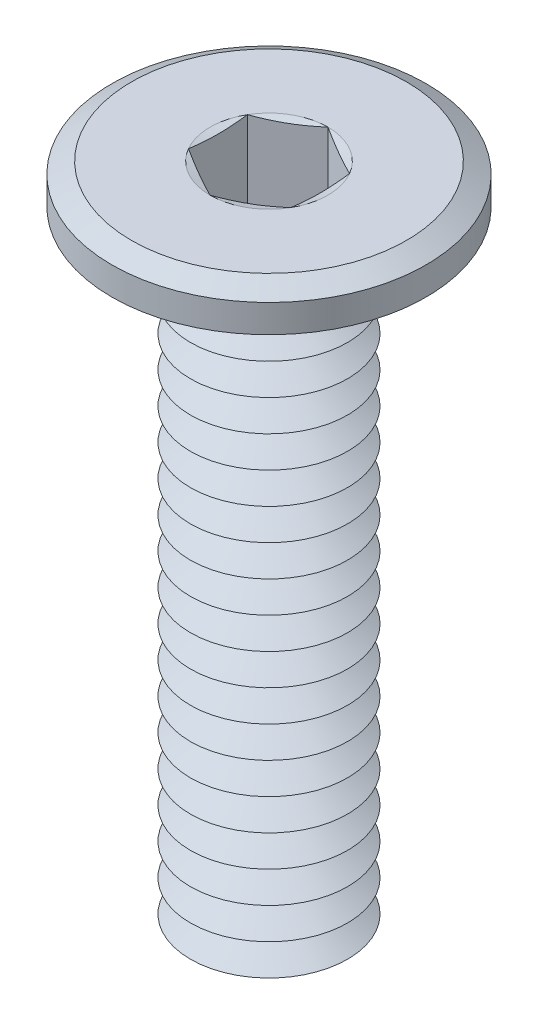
ISO-10303-21;
HEADER;
FILE_DESCRIPTION(('STEP AP214'),'2;1');
FILE_NAME('part.step','',(''),(''),'','','');
FILE_SCHEMA(('AUTOMOTIVE_DESIGN { 1 0 10303 214 1 1 1 1 }'));
ENDSEC;
DATA;
#1=APPLICATION_CONTEXT('core data for automotive mechanical design processes');
#2=APPLICATION_PROTOCOL_DEFINITION('international standard','automotive_design',2000,#1);
#3=PRODUCT_CONTEXT('',#1,'mechanical');
#4=PRODUCT('Part','Part','',(#3));
#5=PRODUCT_RELATED_PRODUCT_CATEGORY('part','',(#4));
#6=PRODUCT_DEFINITION_FORMATION('','',#4);
#7=PRODUCT_DEFINITION_CONTEXT('part definition',#1,'design');
#8=PRODUCT_DEFINITION('design','',#6,#7);
#9=PRODUCT_DEFINITION_SHAPE('','',#8);
#10=(LENGTH_UNIT() NAMED_UNIT(*) SI_UNIT(.MILLI.,.METRE.));
#11=(NAMED_UNIT(*) PLANE_ANGLE_UNIT() SI_UNIT($,.RADIAN.));
#12=(NAMED_UNIT(*) SI_UNIT($,.STERADIAN.) SOLID_ANGLE_UNIT());
#13=UNCERTAINTY_MEASURE_WITH_UNIT(LENGTH_MEASURE(1.E-05),#10,'distance_accuracy_value','');
#14=(GEOMETRIC_REPRESENTATION_CONTEXT(3) GLOBAL_UNCERTAINTY_ASSIGNED_CONTEXT((#13)) GLOBAL_UNIT_ASSIGNED_CONTEXT((#10,
#11,#12)) REPRESENTATION_CONTEXT('',''));
#15=CARTESIAN_POINT('',(0.,0.,0.));
#16=DIRECTION('',(0.,0.,1.));
#17=DIRECTION('',(1.,0.,0.));
#18=AXIS2_PLACEMENT_3D('',#15,#16,#17);
#19=CARTESIAN_POINT('',(0.,-7.9,0.));
#20=DIRECTION('',(0.,-1.,0.));
#21=DIRECTION('',(0.,0.,-1.));
#22=AXIS2_PLACEMENT_3D('',#19,#20,#21);
#23=CONICAL_SURFACE('',#22,1.,1.0471975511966);
#24=CARTESIAN_POINT('',(0.,-7.7,0.));
#25=DIRECTION('',(0.,1.,0.));
#26=DIRECTION('',(0.,0.,1.));
#27=AXIS2_PLACEMENT_3D('',#24,#25,#26);
#28=CIRCLE('',#27,0.653589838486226);
#29=CARTESIAN_POINT('',(0.,-7.7,0.653589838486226));
#30=VERTEX_POINT('',#29);
#31=EDGE_CURVE('E506',#30,#30,#28,.T.);
#32=ORIENTED_EDGE('',*,*,#31,.F.);
#33=EDGE_LOOP('',(#32));
#34=FACE_BOUND('',#33,.T.);
#35=CARTESIAN_POINT('',(0.,-7.9,0.));
#36=DIRECTION('',(0.,1.,0.));
#37=DIRECTION('',(0.,0.,1.));
#38=AXIS2_PLACEMENT_3D('',#35,#36,#37);
#39=CIRCLE('',#38,1.);
#40=CARTESIAN_POINT('',(0.,-7.9,1.));
#41=VERTEX_POINT('',#40);
#42=EDGE_CURVE('E510',#41,#41,#39,.T.);
#43=ORIENTED_EDGE('',*,*,#42,.T.);
#44=EDGE_LOOP('',(#43));
#45=FACE_BOUND('',#44,.T.);
#46=ADVANCED_FACE('F39',(#34,#45),#23,.T.);
#47=CARTESIAN_POINT('',(0.,-7.7,0.));
#48=DIRECTION('',(0.,1.,0.));
#49=DIRECTION('',(0.,0.,1.));
#50=AXIS2_PLACEMENT_3D('',#47,#48,#49);
#51=CONICAL_SURFACE('',#50,0.653589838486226,1.0471975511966);
#52=CARTESIAN_POINT('',(0.,-7.5,0.));
#53=DIRECTION('',(0.,1.,0.));
#54=DIRECTION('',(0.,0.,1.));
#55=AXIS2_PLACEMENT_3D('',#52,#53,#54);
#56=CIRCLE('',#55,1.);
#57=CARTESIAN_POINT('',(0.,-7.5,1.));
#58=VERTEX_POINT('',#57);
#59=EDGE_CURVE('E502',#58,#58,#56,.T.);
#60=ORIENTED_EDGE('',*,*,#59,.F.);
#61=EDGE_LOOP('',(#60));
#62=FACE_BOUND('',#61,.T.);
#63=ORIENTED_EDGE('',*,*,#31,.T.);
#64=EDGE_LOOP('',(#63));
#65=FACE_BOUND('',#64,.T.);
#66=ADVANCED_FACE('F233',(#62,#65),#51,.T.);
#67=CARTESIAN_POINT('',(0.,-8.5,0.));
#68=DIRECTION('',(0.,-1.,0.));
#69=DIRECTION('',(0.,0.,-1.));
#70=AXIS2_PLACEMENT_3D('',#67,#68,#69);
#71=PLANE('',#70);
#72=CARTESIAN_POINT('',(0.,-8.5,0.));
#73=DIRECTION('',(0.,1.,0.));
#74=DIRECTION('',(0.,0.,1.));
#75=AXIS2_PLACEMENT_3D('',#72,#73,#74);
#76=CIRCLE('',#75,0.653589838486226);
#77=CARTESIAN_POINT('',(0.,-8.5,0.653589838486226));
#78=VERTEX_POINT('',#77);
#79=EDGE_CURVE('E300',#78,#78,#76,.T.);
#80=ORIENTED_EDGE('',*,*,#79,.F.);
#81=EDGE_LOOP('',(#80));
#82=FACE_BOUND('',#81,.T.);
#83=ADVANCED_FACE('F239',(#82),#71,.T.);
#84=CARTESIAN_POINT('',(0.,-8.5,0.));
#85=DIRECTION('',(0.,1.,0.));
#86=DIRECTION('',(0.,0.,1.));
#87=AXIS2_PLACEMENT_3D('',#84,#85,#86);
#88=CONICAL_SURFACE('',#87,0.653589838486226,1.0471975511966);
#89=CARTESIAN_POINT('',(0.,-8.3,0.));
#90=DIRECTION('',(0.,1.,0.));
#91=DIRECTION('',(0.,0.,1.));
#92=AXIS2_PLACEMENT_3D('',#89,#90,#91);
#93=CIRCLE('',#92,1.);
#94=CARTESIAN_POINT('',(0.,-8.3,1.));
#95=VERTEX_POINT('',#94);
#96=EDGE_CURVE('E517',#95,#95,#93,.T.);
#97=ORIENTED_EDGE('',*,*,#96,.F.);
#98=EDGE_LOOP('',(#97));
#99=FACE_BOUND('',#98,.T.);
#100=ORIENTED_EDGE('',*,*,#79,.T.);
#101=EDGE_LOOP('',(#100));
#102=FACE_BOUND('',#101,.T.);
#103=ADVANCED_FACE('F254',(#99,#102),#88,.T.);
#104=CARTESIAN_POINT('',(0.,-8.3,0.));
#105=DIRECTION('',(0.,-1.,0.));
#106=DIRECTION('',(0.,0.,-1.));
#107=AXIS2_PLACEMENT_3D('',#104,#105,#106);
#108=CONICAL_SURFACE('',#107,1.,1.0471975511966);
#109=CARTESIAN_POINT('',(0.,-8.1,0.));
#110=DIRECTION('',(0.,1.,0.));
#111=DIRECTION('',(0.,0.,1.));
#112=AXIS2_PLACEMENT_3D('',#109,#110,#111);
#113=CIRCLE('',#112,0.653589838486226);
#114=CARTESIAN_POINT('',(0.,-8.1,0.653589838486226));
#115=VERTEX_POINT('',#114);
#116=EDGE_CURVE('E513',#115,#115,#113,.T.);
#117=ORIENTED_EDGE('',*,*,#116,.F.);
#118=EDGE_LOOP('',(#117));
#119=FACE_BOUND('',#118,.T.);
#120=ORIENTED_EDGE('',*,*,#96,.T.);
#121=EDGE_LOOP('',(#120));
#122=FACE_BOUND('',#121,.T.);
#123=ADVANCED_FACE('F250',(#119,#122),#108,.T.);
#124=CARTESIAN_POINT('',(0.,-8.1,0.));
#125=DIRECTION('',(0.,1.,0.));
#126=DIRECTION('',(0.,0.,1.));
#127=AXIS2_PLACEMENT_3D('',#124,#125,#126);
#128=CONICAL_SURFACE('',#127,0.653589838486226,1.0471975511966);
#129=ORIENTED_EDGE('',*,*,#42,.F.);
#130=EDGE_LOOP('',(#129));
#131=FACE_BOUND('',#130,.T.);
#132=ORIENTED_EDGE('',*,*,#116,.T.);
#133=EDGE_LOOP('',(#132));
#134=FACE_BOUND('',#133,.T.);
#135=ADVANCED_FACE('F246',(#131,#134),#128,.T.);
#136=CARTESIAN_POINT('',(0.,-7.5,0.));
#137=DIRECTION('',(0.,-1.,0.));
#138=DIRECTION('',(0.,0.,-1.));
#139=AXIS2_PLACEMENT_3D('',#136,#137,#138);
#140=CONICAL_SURFACE('',#139,1.,1.0471975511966);
#141=CARTESIAN_POINT('',(0.,-7.3,0.));
#142=DIRECTION('',(0.,1.,0.));
#143=DIRECTION('',(0.,0.,1.));
#144=AXIS2_PLACEMENT_3D('',#141,#142,#143);
#145=CIRCLE('',#144,0.653589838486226);
#146=CARTESIAN_POINT('',(0.,-7.3,0.653589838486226));
#147=VERTEX_POINT('',#146);
#148=EDGE_CURVE('E498',#147,#147,#145,.T.);
#149=ORIENTED_EDGE('',*,*,#148,.F.);
#150=EDGE_LOOP('',(#149));
#151=FACE_BOUND('',#150,.T.);
#152=ORIENTED_EDGE('',*,*,#59,.T.);
#153=EDGE_LOOP('',(#152));
#154=FACE_BOUND('',#153,.T.);
#155=ADVANCED_FACE('F249',(#151,#154),#140,.T.);
#156=CARTESIAN_POINT('',(0.,-7.3,0.));
#157=DIRECTION('',(0.,1.,0.));
#158=DIRECTION('',(0.,0.,1.));
#159=AXIS2_PLACEMENT_3D('',#156,#157,#158);
#160=CONICAL_SURFACE('',#159,0.653589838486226,1.0471975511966);
#161=CARTESIAN_POINT('',(0.,-7.1,0.));
#162=DIRECTION('',(0.,1.,0.));
#163=DIRECTION('',(0.,0.,1.));
#164=AXIS2_PLACEMENT_3D('',#161,#162,#163);
#165=CIRCLE('',#164,1.);
#166=CARTESIAN_POINT('',(0.,-7.1,1.));
#167=VERTEX_POINT('',#166);
#168=EDGE_CURVE('E494',#167,#167,#165,.T.);
#169=ORIENTED_EDGE('',*,*,#168,.F.);
#170=EDGE_LOOP('',(#169));
#171=FACE_BOUND('',#170,.T.);
#172=ORIENTED_EDGE('',*,*,#148,.T.);
#173=EDGE_LOOP('',(#172));
#174=FACE_BOUND('',#173,.T.);
#175=ADVANCED_FACE('F890',(#171,#174),#160,.T.);
#176=CARTESIAN_POINT('',(0.,-7.1,0.));
#177=DIRECTION('',(0.,-1.,0.));
#178=DIRECTION('',(0.,0.,-1.));
#179=AXIS2_PLACEMENT_3D('',#176,#177,#178);
#180=CONICAL_SURFACE('',#179,1.,1.0471975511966);
#181=CARTESIAN_POINT('',(0.,-6.9,0.));
#182=DIRECTION('',(0.,1.,0.));
#183=DIRECTION('',(0.,0.,1.));
#184=AXIS2_PLACEMENT_3D('',#181,#182,#183);
#185=CIRCLE('',#184,0.653589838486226);
#186=CARTESIAN_POINT('',(0.,-6.9,0.653589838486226));
#187=VERTEX_POINT('',#186);
#188=EDGE_CURVE('E490',#187,#187,#185,.T.);
#189=ORIENTED_EDGE('',*,*,#188,.F.);
#190=EDGE_LOOP('',(#189));
#191=FACE_BOUND('',#190,.T.);
#192=ORIENTED_EDGE('',*,*,#168,.T.);
#193=EDGE_LOOP('',(#192));
#194=FACE_BOUND('',#193,.T.);
#195=ADVANCED_FACE('F881',(#191,#194),#180,.T.);
#196=CARTESIAN_POINT('',(0.,-6.9,0.));
#197=DIRECTION('',(0.,1.,0.));
#198=DIRECTION('',(0.,0.,1.));
#199=AXIS2_PLACEMENT_3D('',#196,#197,#198);
#200=CONICAL_SURFACE('',#199,0.653589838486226,1.0471975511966);
#201=CARTESIAN_POINT('',(0.,-6.7,0.));
#202=DIRECTION('',(0.,1.,0.));
#203=DIRECTION('',(0.,0.,1.));
#204=AXIS2_PLACEMENT_3D('',#201,#202,#203);
#205=CIRCLE('',#204,1.);
#206=CARTESIAN_POINT('',(0.,-6.7,1.));
#207=VERTEX_POINT('',#206);
#208=EDGE_CURVE('E486',#207,#207,#205,.T.);
#209=ORIENTED_EDGE('',*,*,#208,.F.);
#210=EDGE_LOOP('',(#209));
#211=FACE_BOUND('',#210,.T.);
#212=ORIENTED_EDGE('',*,*,#188,.T.);
#213=EDGE_LOOP('',(#212));
#214=FACE_BOUND('',#213,.T.);
#215=ADVANCED_FACE('F872',(#211,#214),#200,.T.);
#216=CARTESIAN_POINT('',(0.,-6.7,0.));
#217=DIRECTION('',(0.,-1.,0.));
#218=DIRECTION('',(0.,0.,-1.));
#219=AXIS2_PLACEMENT_3D('',#216,#217,#218);
#220=CONICAL_SURFACE('',#219,1.,1.0471975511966);
#221=CARTESIAN_POINT('',(0.,-6.5,0.));
#222=DIRECTION('',(0.,1.,0.));
#223=DIRECTION('',(0.,0.,1.));
#224=AXIS2_PLACEMENT_3D('',#221,#222,#223);
#225=CIRCLE('',#224,0.653589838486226);
#226=CARTESIAN_POINT('',(0.,-6.5,0.653589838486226));
#227=VERTEX_POINT('',#226);
#228=EDGE_CURVE('E482',#227,#227,#225,.T.);
#229=ORIENTED_EDGE('',*,*,#228,.F.);
#230=EDGE_LOOP('',(#229));
#231=FACE_BOUND('',#230,.T.);
#232=ORIENTED_EDGE('',*,*,#208,.T.);
#233=EDGE_LOOP('',(#232));
#234=FACE_BOUND('',#233,.T.);
#235=ADVANCED_FACE('F863',(#231,#234),#220,.T.);
#236=CARTESIAN_POINT('',(0.,-6.5,0.));
#237=DIRECTION('',(0.,1.,0.));
#238=DIRECTION('',(0.,0.,1.));
#239=AXIS2_PLACEMENT_3D('',#236,#237,#238);
#240=CONICAL_SURFACE('',#239,0.653589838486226,1.0471975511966);
#241=CARTESIAN_POINT('',(0.,-6.3,0.));
#242=DIRECTION('',(0.,1.,0.));
#243=DIRECTION('',(0.,0.,1.));
#244=AXIS2_PLACEMENT_3D('',#241,#242,#243);
#245=CIRCLE('',#244,1.);
#246=CARTESIAN_POINT('',(0.,-6.3,1.));
#247=VERTEX_POINT('',#246);
#248=EDGE_CURVE('E478',#247,#247,#245,.T.);
#249=ORIENTED_EDGE('',*,*,#248,.F.);
#250=EDGE_LOOP('',(#249));
#251=FACE_BOUND('',#250,.T.);
#252=ORIENTED_EDGE('',*,*,#228,.T.);
#253=EDGE_LOOP('',(#252));
#254=FACE_BOUND('',#253,.T.);
#255=ADVANCED_FACE('F854',(#251,#254),#240,.T.);
#256=CARTESIAN_POINT('',(0.,-6.3,0.));
#257=DIRECTION('',(0.,-1.,0.));
#258=DIRECTION('',(0.,0.,-1.));
#259=AXIS2_PLACEMENT_3D('',#256,#257,#258);
#260=CONICAL_SURFACE('',#259,1.,1.0471975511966);
#261=CARTESIAN_POINT('',(0.,-6.1,0.));
#262=DIRECTION('',(0.,1.,0.));
#263=DIRECTION('',(0.,0.,1.));
#264=AXIS2_PLACEMENT_3D('',#261,#262,#263);
#265=CIRCLE('',#264,0.653589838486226);
#266=CARTESIAN_POINT('',(0.,-6.1,0.653589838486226));
#267=VERTEX_POINT('',#266);
#268=EDGE_CURVE('E474',#267,#267,#265,.T.);
#269=ORIENTED_EDGE('',*,*,#268,.F.);
#270=EDGE_LOOP('',(#269));
#271=FACE_BOUND('',#270,.T.);
#272=ORIENTED_EDGE('',*,*,#248,.T.);
#273=EDGE_LOOP('',(#272));
#274=FACE_BOUND('',#273,.T.);
#275=ADVANCED_FACE('F845',(#271,#274),#260,.T.);
#276=CARTESIAN_POINT('',(0.,-6.1,0.));
#277=DIRECTION('',(0.,1.,0.));
#278=DIRECTION('',(0.,0.,1.));
#279=AXIS2_PLACEMENT_3D('',#276,#277,#278);
#280=CONICAL_SURFACE('',#279,0.653589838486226,1.0471975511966);
#281=CARTESIAN_POINT('',(0.,-5.9,0.));
#282=DIRECTION('',(0.,1.,0.));
#283=DIRECTION('',(0.,0.,1.));
#284=AXIS2_PLACEMENT_3D('',#281,#282,#283);
#285=CIRCLE('',#284,1.);
#286=CARTESIAN_POINT('',(0.,-5.9,1.));
#287=VERTEX_POINT('',#286);
#288=EDGE_CURVE('E470',#287,#287,#285,.T.);
#289=ORIENTED_EDGE('',*,*,#288,.F.);
#290=EDGE_LOOP('',(#289));
#291=FACE_BOUND('',#290,.T.);
#292=ORIENTED_EDGE('',*,*,#268,.T.);
#293=EDGE_LOOP('',(#292));
#294=FACE_BOUND('',#293,.T.);
#295=ADVANCED_FACE('F836',(#291,#294),#280,.T.);
#296=CARTESIAN_POINT('',(0.,-5.9,0.));
#297=DIRECTION('',(0.,-1.,0.));
#298=DIRECTION('',(0.,0.,-1.));
#299=AXIS2_PLACEMENT_3D('',#296,#297,#298);
#300=CONICAL_SURFACE('',#299,1.,1.0471975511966);
#301=CARTESIAN_POINT('',(0.,-5.7,0.));
#302=DIRECTION('',(0.,1.,0.));
#303=DIRECTION('',(0.,0.,1.));
#304=AXIS2_PLACEMENT_3D('',#301,#302,#303);
#305=CIRCLE('',#304,0.653589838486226);
#306=CARTESIAN_POINT('',(0.,-5.7,0.653589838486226));
#307=VERTEX_POINT('',#306);
#308=EDGE_CURVE('E466',#307,#307,#305,.T.);
#309=ORIENTED_EDGE('',*,*,#308,.F.);
#310=EDGE_LOOP('',(#309));
#311=FACE_BOUND('',#310,.T.);
#312=ORIENTED_EDGE('',*,*,#288,.T.);
#313=EDGE_LOOP('',(#312));
#314=FACE_BOUND('',#313,.T.);
#315=ADVANCED_FACE('F827',(#311,#314),#300,.T.);
#316=CARTESIAN_POINT('',(0.,-5.7,0.));
#317=DIRECTION('',(0.,1.,0.));
#318=DIRECTION('',(0.,0.,1.));
#319=AXIS2_PLACEMENT_3D('',#316,#317,#318);
#320=CONICAL_SURFACE('',#319,0.653589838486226,1.0471975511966);
#321=CARTESIAN_POINT('',(0.,-5.5,0.));
#322=DIRECTION('',(0.,1.,0.));
#323=DIRECTION('',(0.,0.,1.));
#324=AXIS2_PLACEMENT_3D('',#321,#322,#323);
#325=CIRCLE('',#324,1.);
#326=CARTESIAN_POINT('',(0.,-5.5,1.));
#327=VERTEX_POINT('',#326);
#328=EDGE_CURVE('E463',#327,#327,#325,.T.);
#329=ORIENTED_EDGE('',*,*,#328,.F.);
#330=EDGE_LOOP('',(#329));
#331=FACE_BOUND('',#330,.T.);
#332=ORIENTED_EDGE('',*,*,#308,.T.);
#333=EDGE_LOOP('',(#332));
#334=FACE_BOUND('',#333,.T.);
#335=ADVANCED_FACE('F818',(#331,#334),#320,.T.);
#336=CARTESIAN_POINT('',(0.,-5.5,0.));
#337=DIRECTION('',(0.,-1.,0.));
#338=DIRECTION('',(0.,0.,-1.));
#339=AXIS2_PLACEMENT_3D('',#336,#337,#338);
#340=CONICAL_SURFACE('',#339,1.,1.0471975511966);
#341=CARTESIAN_POINT('',(0.,-5.3,0.));
#342=DIRECTION('',(0.,1.,0.));
#343=DIRECTION('',(0.,0.,1.));
#344=AXIS2_PLACEMENT_3D('',#341,#342,#343);
#345=CIRCLE('',#344,0.653589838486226);
#346=CARTESIAN_POINT('',(0.,-5.3,0.653589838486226));
#347=VERTEX_POINT('',#346);
#348=EDGE_CURVE('E459',#347,#347,#345,.T.);
#349=ORIENTED_EDGE('',*,*,#348,.F.);
#350=EDGE_LOOP('',(#349));
#351=FACE_BOUND('',#350,.T.);
#352=ORIENTED_EDGE('',*,*,#328,.T.);
#353=EDGE_LOOP('',(#352));
#354=FACE_BOUND('',#353,.T.);
#355=ADVANCED_FACE('F809',(#351,#354),#340,.T.);
#356=CARTESIAN_POINT('',(0.,-5.3,0.));
#357=DIRECTION('',(0.,1.,0.));
#358=DIRECTION('',(0.,0.,1.));
#359=AXIS2_PLACEMENT_3D('',#356,#357,#358);
#360=CONICAL_SURFACE('',#359,0.653589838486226,1.0471975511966);
#361=CARTESIAN_POINT('',(0.,-5.1,0.));
#362=DIRECTION('',(0.,1.,0.));
#363=DIRECTION('',(0.,0.,1.));
#364=AXIS2_PLACEMENT_3D('',#361,#362,#363);
#365=CIRCLE('',#364,1.);
#366=CARTESIAN_POINT('',(0.,-5.1,1.));
#367=VERTEX_POINT('',#366);
#368=EDGE_CURVE('E455',#367,#367,#365,.T.);
#369=ORIENTED_EDGE('',*,*,#368,.F.);
#370=EDGE_LOOP('',(#369));
#371=FACE_BOUND('',#370,.T.);
#372=ORIENTED_EDGE('',*,*,#348,.T.);
#373=EDGE_LOOP('',(#372));
#374=FACE_BOUND('',#373,.T.);
#375=ADVANCED_FACE('F800',(#371,#374),#360,.T.);
#376=CARTESIAN_POINT('',(0.,-5.1,0.));
#377=DIRECTION('',(0.,-1.,0.));
#378=DIRECTION('',(0.,0.,-1.));
#379=AXIS2_PLACEMENT_3D('',#376,#377,#378);
#380=CONICAL_SURFACE('',#379,1.,1.0471975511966);
#381=CARTESIAN_POINT('',(0.,-4.9,0.));
#382=DIRECTION('',(0.,1.,0.));
#383=DIRECTION('',(0.,0.,1.));
#384=AXIS2_PLACEMENT_3D('',#381,#382,#383);
#385=CIRCLE('',#384,0.653589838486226);
#386=CARTESIAN_POINT('',(0.,-4.9,0.653589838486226));
#387=VERTEX_POINT('',#386);
#388=EDGE_CURVE('E451',#387,#387,#385,.T.);
#389=ORIENTED_EDGE('',*,*,#388,.F.);
#390=EDGE_LOOP('',(#389));
#391=FACE_BOUND('',#390,.T.);
#392=ORIENTED_EDGE('',*,*,#368,.T.);
#393=EDGE_LOOP('',(#392));
#394=FACE_BOUND('',#393,.T.);
#395=ADVANCED_FACE('F791',(#391,#394),#380,.T.);
#396=CARTESIAN_POINT('',(0.,-4.9,0.));
#397=DIRECTION('',(0.,1.,0.));
#398=DIRECTION('',(0.,0.,1.));
#399=AXIS2_PLACEMENT_3D('',#396,#397,#398);
#400=CONICAL_SURFACE('',#399,0.653589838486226,1.0471975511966);
#401=CARTESIAN_POINT('',(0.,-4.7,0.));
#402=DIRECTION('',(0.,1.,0.));
#403=DIRECTION('',(0.,0.,1.));
#404=AXIS2_PLACEMENT_3D('',#401,#402,#403);
#405=CIRCLE('',#404,1.);
#406=CARTESIAN_POINT('',(0.,-4.7,1.));
#407=VERTEX_POINT('',#406);
#408=EDGE_CURVE('E447',#407,#407,#405,.T.);
#409=ORIENTED_EDGE('',*,*,#408,.F.);
#410=EDGE_LOOP('',(#409));
#411=FACE_BOUND('',#410,.T.);
#412=ORIENTED_EDGE('',*,*,#388,.T.);
#413=EDGE_LOOP('',(#412));
#414=FACE_BOUND('',#413,.T.);
#415=ADVANCED_FACE('F782',(#411,#414),#400,.T.);
#416=CARTESIAN_POINT('',(0.,-4.7,0.));
#417=DIRECTION('',(0.,-1.,0.));
#418=DIRECTION('',(0.,0.,-1.));
#419=AXIS2_PLACEMENT_3D('',#416,#417,#418);
#420=CONICAL_SURFACE('',#419,1.,1.0471975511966);
#421=CARTESIAN_POINT('',(0.,-4.5,0.));
#422=DIRECTION('',(0.,1.,0.));
#423=DIRECTION('',(0.,0.,1.));
#424=AXIS2_PLACEMENT_3D('',#421,#422,#423);
#425=CIRCLE('',#424,0.653589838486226);
#426=CARTESIAN_POINT('',(0.,-4.5,0.653589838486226));
#427=VERTEX_POINT('',#426);
#428=EDGE_CURVE('E443',#427,#427,#425,.T.);
#429=ORIENTED_EDGE('',*,*,#428,.F.);
#430=EDGE_LOOP('',(#429));
#431=FACE_BOUND('',#430,.T.);
#432=ORIENTED_EDGE('',*,*,#408,.T.);
#433=EDGE_LOOP('',(#432));
#434=FACE_BOUND('',#433,.T.);
#435=ADVANCED_FACE('F773',(#431,#434),#420,.T.);
#436=CARTESIAN_POINT('',(0.,-4.5,0.));
#437=DIRECTION('',(0.,1.,0.));
#438=DIRECTION('',(0.,0.,1.));
#439=AXIS2_PLACEMENT_3D('',#436,#437,#438);
#440=CONICAL_SURFACE('',#439,0.653589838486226,1.0471975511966);
#441=CARTESIAN_POINT('',(0.,-4.3,0.));
#442=DIRECTION('',(0.,1.,0.));
#443=DIRECTION('',(0.,0.,1.));
#444=AXIS2_PLACEMENT_3D('',#441,#442,#443);
#445=CIRCLE('',#444,1.);
#446=CARTESIAN_POINT('',(0.,-4.3,1.));
#447=VERTEX_POINT('',#446);
#448=EDGE_CURVE('E440',#447,#447,#445,.T.);
#449=ORIENTED_EDGE('',*,*,#448,.F.);
#450=EDGE_LOOP('',(#449));
#451=FACE_BOUND('',#450,.T.);
#452=ORIENTED_EDGE('',*,*,#428,.T.);
#453=EDGE_LOOP('',(#452));
#454=FACE_BOUND('',#453,.T.);
#455=ADVANCED_FACE('F764',(#451,#454),#440,.T.);
#456=CARTESIAN_POINT('',(0.,-4.3,0.));
#457=DIRECTION('',(0.,-1.,0.));
#458=DIRECTION('',(0.,0.,-1.));
#459=AXIS2_PLACEMENT_3D('',#456,#457,#458);
#460=CONICAL_SURFACE('',#459,1.,1.0471975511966);
#461=CARTESIAN_POINT('',(0.,-4.1,0.));
#462=DIRECTION('',(0.,1.,0.));
#463=DIRECTION('',(0.,0.,1.));
#464=AXIS2_PLACEMENT_3D('',#461,#462,#463);
#465=CIRCLE('',#464,0.653589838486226);
#466=CARTESIAN_POINT('',(0.,-4.1,0.653589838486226));
#467=VERTEX_POINT('',#466);
#468=EDGE_CURVE('E436',#467,#467,#465,.T.);
#469=ORIENTED_EDGE('',*,*,#468,.F.);
#470=EDGE_LOOP('',(#469));
#471=FACE_BOUND('',#470,.T.);
#472=ORIENTED_EDGE('',*,*,#448,.T.);
#473=EDGE_LOOP('',(#472));
#474=FACE_BOUND('',#473,.T.);
#475=ADVANCED_FACE('F755',(#471,#474),#460,.T.);
#476=CARTESIAN_POINT('',(0.,-4.1,0.));
#477=DIRECTION('',(0.,1.,0.));
#478=DIRECTION('',(0.,0.,1.));
#479=AXIS2_PLACEMENT_3D('',#476,#477,#478);
#480=CONICAL_SURFACE('',#479,0.653589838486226,1.0471975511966);
#481=CARTESIAN_POINT('',(0.,-3.9,0.));
#482=DIRECTION('',(0.,1.,0.));
#483=DIRECTION('',(0.,0.,1.));
#484=AXIS2_PLACEMENT_3D('',#481,#482,#483);
#485=CIRCLE('',#484,1.);
#486=CARTESIAN_POINT('',(0.,-3.9,1.));
#487=VERTEX_POINT('',#486);
#488=EDGE_CURVE('E432',#487,#487,#485,.T.);
#489=ORIENTED_EDGE('',*,*,#488,.F.);
#490=EDGE_LOOP('',(#489));
#491=FACE_BOUND('',#490,.T.);
#492=ORIENTED_EDGE('',*,*,#468,.T.);
#493=EDGE_LOOP('',(#492));
#494=FACE_BOUND('',#493,.T.);
#495=ADVANCED_FACE('F746',(#491,#494),#480,.T.);
#496=CARTESIAN_POINT('',(0.,-3.9,0.));
#497=DIRECTION('',(0.,-1.,0.));
#498=DIRECTION('',(0.,0.,-1.));
#499=AXIS2_PLACEMENT_3D('',#496,#497,#498);
#500=CONICAL_SURFACE('',#499,1.,1.0471975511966);
#501=CARTESIAN_POINT('',(0.,-3.7,0.));
#502=DIRECTION('',(0.,1.,0.));
#503=DIRECTION('',(0.,0.,1.));
#504=AXIS2_PLACEMENT_3D('',#501,#502,#503);
#505=CIRCLE('',#504,0.653589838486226);
#506=CARTESIAN_POINT('',(0.,-3.7,0.653589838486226));
#507=VERTEX_POINT('',#506);
#508=EDGE_CURVE('E428',#507,#507,#505,.T.);
#509=ORIENTED_EDGE('',*,*,#508,.F.);
#510=EDGE_LOOP('',(#509));
#511=FACE_BOUND('',#510,.T.);
#512=ORIENTED_EDGE('',*,*,#488,.T.);
#513=EDGE_LOOP('',(#512));
#514=FACE_BOUND('',#513,.T.);
#515=ADVANCED_FACE('F737',(#511,#514),#500,.T.);
#516=CARTESIAN_POINT('',(0.,-3.7,0.));
#517=DIRECTION('',(0.,1.,0.));
#518=DIRECTION('',(0.,0.,1.));
#519=AXIS2_PLACEMENT_3D('',#516,#517,#518);
#520=CONICAL_SURFACE('',#519,0.653589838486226,1.0471975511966);
#521=CARTESIAN_POINT('',(0.,-3.5,0.));
#522=DIRECTION('',(0.,1.,0.));
#523=DIRECTION('',(0.,0.,1.));
#524=AXIS2_PLACEMENT_3D('',#521,#522,#523);
#525=CIRCLE('',#524,1.);
#526=CARTESIAN_POINT('',(0.,-3.5,1.));
#527=VERTEX_POINT('',#526);
#528=EDGE_CURVE('E424',#527,#527,#525,.T.);
#529=ORIENTED_EDGE('',*,*,#528,.F.);
#530=EDGE_LOOP('',(#529));
#531=FACE_BOUND('',#530,.T.);
#532=ORIENTED_EDGE('',*,*,#508,.T.);
#533=EDGE_LOOP('',(#532));
#534=FACE_BOUND('',#533,.T.);
#535=ADVANCED_FACE('F728',(#531,#534),#520,.T.);
#536=CARTESIAN_POINT('',(0.,-3.5,0.));
#537=DIRECTION('',(0.,-1.,0.));
#538=DIRECTION('',(0.,0.,-1.));
#539=AXIS2_PLACEMENT_3D('',#536,#537,#538);
#540=CONICAL_SURFACE('',#539,1.,1.0471975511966);
#541=CARTESIAN_POINT('',(0.,-3.3,0.));
#542=DIRECTION('',(0.,1.,0.));
#543=DIRECTION('',(0.,0.,1.));
#544=AXIS2_PLACEMENT_3D('',#541,#542,#543);
#545=CIRCLE('',#544,0.653589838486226);
#546=CARTESIAN_POINT('',(0.,-3.3,0.653589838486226));
#547=VERTEX_POINT('',#546);
#548=EDGE_CURVE('E421',#547,#547,#545,.T.);
#549=ORIENTED_EDGE('',*,*,#548,.F.);
#550=EDGE_LOOP('',(#549));
#551=FACE_BOUND('',#550,.T.);
#552=ORIENTED_EDGE('',*,*,#528,.T.);
#553=EDGE_LOOP('',(#552));
#554=FACE_BOUND('',#553,.T.);
#555=ADVANCED_FACE('F719',(#551,#554),#540,.T.);
#556=CARTESIAN_POINT('',(0.,-3.3,0.));
#557=DIRECTION('',(0.,1.,0.));
#558=DIRECTION('',(0.,0.,1.));
#559=AXIS2_PLACEMENT_3D('',#556,#557,#558);
#560=CONICAL_SURFACE('',#559,0.653589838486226,1.0471975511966);
#561=CARTESIAN_POINT('',(0.,-3.1,0.));
#562=DIRECTION('',(0.,1.,0.));
#563=DIRECTION('',(0.,0.,1.));
#564=AXIS2_PLACEMENT_3D('',#561,#562,#563);
#565=CIRCLE('',#564,1.);
#566=CARTESIAN_POINT('',(0.,-3.1,1.));
#567=VERTEX_POINT('',#566);
#568=EDGE_CURVE('E417',#567,#567,#565,.T.);
#569=ORIENTED_EDGE('',*,*,#568,.F.);
#570=EDGE_LOOP('',(#569));
#571=FACE_BOUND('',#570,.T.);
#572=ORIENTED_EDGE('',*,*,#548,.T.);
#573=EDGE_LOOP('',(#572));
#574=FACE_BOUND('',#573,.T.);
#575=ADVANCED_FACE('F710',(#571,#574),#560,.T.);
#576=CARTESIAN_POINT('',(0.,-3.1,0.));
#577=DIRECTION('',(0.,-1.,0.));
#578=DIRECTION('',(0.,0.,-1.));
#579=AXIS2_PLACEMENT_3D('',#576,#577,#578);
#580=CONICAL_SURFACE('',#579,1.,1.0471975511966);
#581=CARTESIAN_POINT('',(0.,-2.9,0.));
#582=DIRECTION('',(0.,1.,0.));
#583=DIRECTION('',(0.,0.,1.));
#584=AXIS2_PLACEMENT_3D('',#581,#582,#583);
#585=CIRCLE('',#584,0.653589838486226);
#586=CARTESIAN_POINT('',(0.,-2.9,0.653589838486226));
#587=VERTEX_POINT('',#586);
#588=EDGE_CURVE('E413',#587,#587,#585,.T.);
#589=ORIENTED_EDGE('',*,*,#588,.F.);
#590=EDGE_LOOP('',(#589));
#591=FACE_BOUND('',#590,.T.);
#592=ORIENTED_EDGE('',*,*,#568,.T.);
#593=EDGE_LOOP('',(#592));
#594=FACE_BOUND('',#593,.T.);
#595=ADVANCED_FACE('F701',(#591,#594),#580,.T.);
#596=CARTESIAN_POINT('',(0.,-2.9,0.));
#597=DIRECTION('',(0.,1.,0.));
#598=DIRECTION('',(0.,0.,1.));
#599=AXIS2_PLACEMENT_3D('',#596,#597,#598);
#600=CONICAL_SURFACE('',#599,0.653589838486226,1.0471975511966);
#601=CARTESIAN_POINT('',(0.,-2.7,0.));
#602=DIRECTION('',(0.,1.,0.));
#603=DIRECTION('',(0.,0.,1.));
#604=AXIS2_PLACEMENT_3D('',#601,#602,#603);
#605=CIRCLE('',#604,1.);
#606=CARTESIAN_POINT('',(0.,-2.7,1.));
#607=VERTEX_POINT('',#606);
#608=EDGE_CURVE('E410',#607,#607,#605,.T.);
#609=ORIENTED_EDGE('',*,*,#608,.F.);
#610=EDGE_LOOP('',(#609));
#611=FACE_BOUND('',#610,.T.);
#612=ORIENTED_EDGE('',*,*,#588,.T.);
#613=EDGE_LOOP('',(#612));
#614=FACE_BOUND('',#613,.T.);
#615=ADVANCED_FACE('F692',(#611,#614),#600,.T.);
#616=CARTESIAN_POINT('',(0.,-2.7,0.));
#617=DIRECTION('',(0.,-1.,0.));
#618=DIRECTION('',(0.,0.,-1.));
#619=AXIS2_PLACEMENT_3D('',#616,#617,#618);
#620=CONICAL_SURFACE('',#619,1.,1.0471975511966);
#621=CARTESIAN_POINT('',(0.,-2.5,0.));
#622=DIRECTION('',(0.,1.,0.));
#623=DIRECTION('',(0.,0.,1.));
#624=AXIS2_PLACEMENT_3D('',#621,#622,#623);
#625=CIRCLE('',#624,0.653589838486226);
#626=CARTESIAN_POINT('',(0.,-2.5,0.653589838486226));
#627=VERTEX_POINT('',#626);
#628=EDGE_CURVE('E406',#627,#627,#625,.T.);
#629=ORIENTED_EDGE('',*,*,#628,.F.);
#630=EDGE_LOOP('',(#629));
#631=FACE_BOUND('',#630,.T.);
#632=ORIENTED_EDGE('',*,*,#608,.T.);
#633=EDGE_LOOP('',(#632));
#634=FACE_BOUND('',#633,.T.);
#635=ADVANCED_FACE('F683',(#631,#634),#620,.T.);
#636=CARTESIAN_POINT('',(0.,-2.5,0.));
#637=DIRECTION('',(0.,1.,0.));
#638=DIRECTION('',(0.,0.,1.));
#639=AXIS2_PLACEMENT_3D('',#636,#637,#638);
#640=CONICAL_SURFACE('',#639,0.653589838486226,1.0471975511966);
#641=CARTESIAN_POINT('',(0.,-2.3,0.));
#642=DIRECTION('',(0.,1.,0.));
#643=DIRECTION('',(0.,0.,1.));
#644=AXIS2_PLACEMENT_3D('',#641,#642,#643);
#645=CIRCLE('',#644,1.);
#646=CARTESIAN_POINT('',(0.,-2.3,1.));
#647=VERTEX_POINT('',#646);
#648=EDGE_CURVE('E402',#647,#647,#645,.T.);
#649=ORIENTED_EDGE('',*,*,#648,.F.);
#650=EDGE_LOOP('',(#649));
#651=FACE_BOUND('',#650,.T.);
#652=ORIENTED_EDGE('',*,*,#628,.T.);
#653=EDGE_LOOP('',(#652));
#654=FACE_BOUND('',#653,.T.);
#655=ADVANCED_FACE('F674',(#651,#654),#640,.T.);
#656=CARTESIAN_POINT('',(0.,-2.3,0.));
#657=DIRECTION('',(0.,-1.,0.));
#658=DIRECTION('',(0.,0.,-1.));
#659=AXIS2_PLACEMENT_3D('',#656,#657,#658);
#660=CONICAL_SURFACE('',#659,1.,1.0471975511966);
#661=CARTESIAN_POINT('',(0.,-2.1,0.));
#662=DIRECTION('',(0.,1.,0.));
#663=DIRECTION('',(0.,0.,1.));
#664=AXIS2_PLACEMENT_3D('',#661,#662,#663);
#665=CIRCLE('',#664,0.653589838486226);
#666=CARTESIAN_POINT('',(0.,-2.1,0.653589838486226));
#667=VERTEX_POINT('',#666);
#668=EDGE_CURVE('E398',#667,#667,#665,.T.);
#669=ORIENTED_EDGE('',*,*,#668,.F.);
#670=EDGE_LOOP('',(#669));
#671=FACE_BOUND('',#670,.T.);
#672=ORIENTED_EDGE('',*,*,#648,.T.);
#673=EDGE_LOOP('',(#672));
#674=FACE_BOUND('',#673,.T.);
#675=ADVANCED_FACE('F665',(#671,#674),#660,.T.);
#676=CARTESIAN_POINT('',(0.,-2.1,0.));
#677=DIRECTION('',(0.,1.,0.));
#678=DIRECTION('',(0.,0.,1.));
#679=AXIS2_PLACEMENT_3D('',#676,#677,#678);
#680=CONICAL_SURFACE('',#679,0.653589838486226,1.0471975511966);
#681=CARTESIAN_POINT('',(0.,-1.9,0.));
#682=DIRECTION('',(0.,1.,0.));
#683=DIRECTION('',(0.,0.,1.));
#684=AXIS2_PLACEMENT_3D('',#681,#682,#683);
#685=CIRCLE('',#684,1.);
#686=CARTESIAN_POINT('',(0.,-1.9,1.));
#687=VERTEX_POINT('',#686);
#688=EDGE_CURVE('E394',#687,#687,#685,.T.);
#689=ORIENTED_EDGE('',*,*,#688,.F.);
#690=EDGE_LOOP('',(#689));
#691=FACE_BOUND('',#690,.T.);
#692=ORIENTED_EDGE('',*,*,#668,.T.);
#693=EDGE_LOOP('',(#692));
#694=FACE_BOUND('',#693,.T.);
#695=ADVANCED_FACE('F656',(#691,#694),#680,.T.);
#696=CARTESIAN_POINT('',(0.,-1.9,0.));
#697=DIRECTION('',(0.,-1.,0.));
#698=DIRECTION('',(0.,0.,-1.));
#699=AXIS2_PLACEMENT_3D('',#696,#697,#698);
#700=CONICAL_SURFACE('',#699,1.,1.0471975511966);
#701=CARTESIAN_POINT('',(0.,-1.7,0.));
#702=DIRECTION('',(0.,1.,0.));
#703=DIRECTION('',(0.,0.,1.));
#704=AXIS2_PLACEMENT_3D('',#701,#702,#703);
#705=CIRCLE('',#704,0.653589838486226);
#706=CARTESIAN_POINT('',(0.,-1.7,0.653589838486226));
#707=VERTEX_POINT('',#706);
#708=EDGE_CURVE('E390',#707,#707,#705,.T.);
#709=ORIENTED_EDGE('',*,*,#708,.F.);
#710=EDGE_LOOP('',(#709));
#711=FACE_BOUND('',#710,.T.);
#712=ORIENTED_EDGE('',*,*,#688,.T.);
#713=EDGE_LOOP('',(#712));
#714=FACE_BOUND('',#713,.T.);
#715=ADVANCED_FACE('F647',(#711,#714),#700,.T.);
#716=CARTESIAN_POINT('',(0.,-1.7,0.));
#717=DIRECTION('',(0.,1.,0.));
#718=DIRECTION('',(0.,0.,1.));
#719=AXIS2_PLACEMENT_3D('',#716,#717,#718);
#720=CONICAL_SURFACE('',#719,0.653589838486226,1.0471975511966);
#721=CARTESIAN_POINT('',(0.,-1.5,0.));
#722=DIRECTION('',(0.,1.,0.));
#723=DIRECTION('',(0.,0.,1.));
#724=AXIS2_PLACEMENT_3D('',#721,#722,#723);
#725=CIRCLE('',#724,1.);
#726=CARTESIAN_POINT('',(0.,-1.5,1.));
#727=VERTEX_POINT('',#726);
#728=EDGE_CURVE('E386',#727,#727,#725,.T.);
#729=ORIENTED_EDGE('',*,*,#728,.F.);
#730=EDGE_LOOP('',(#729));
#731=FACE_BOUND('',#730,.T.);
#732=ORIENTED_EDGE('',*,*,#708,.T.);
#733=EDGE_LOOP('',(#732));
#734=FACE_BOUND('',#733,.T.);
#735=ADVANCED_FACE('F638',(#731,#734),#720,.T.);
#736=CARTESIAN_POINT('',(0.,-1.5,0.));
#737=DIRECTION('',(0.,-1.,0.));
#738=DIRECTION('',(0.,0.,-1.));
#739=AXIS2_PLACEMENT_3D('',#736,#737,#738);
#740=CONICAL_SURFACE('',#739,1.,1.0471975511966);
#741=CARTESIAN_POINT('',(0.,-1.3,0.));
#742=DIRECTION('',(0.,1.,0.));
#743=DIRECTION('',(0.,0.,1.));
#744=AXIS2_PLACEMENT_3D('',#741,#742,#743);
#745=CIRCLE('',#744,0.653589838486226);
#746=CARTESIAN_POINT('',(0.,-1.3,0.653589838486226));
#747=VERTEX_POINT('',#746);
#748=EDGE_CURVE('E382',#747,#747,#745,.T.);
#749=ORIENTED_EDGE('',*,*,#748,.F.);
#750=EDGE_LOOP('',(#749));
#751=FACE_BOUND('',#750,.T.);
#752=ORIENTED_EDGE('',*,*,#728,.T.);
#753=EDGE_LOOP('',(#752));
#754=FACE_BOUND('',#753,.T.);
#755=ADVANCED_FACE('F629',(#751,#754),#740,.T.);
#756=CARTESIAN_POINT('',(0.,-1.3,0.));
#757=DIRECTION('',(0.,1.,0.));
#758=DIRECTION('',(0.,0.,1.));
#759=AXIS2_PLACEMENT_3D('',#756,#757,#758);
#760=CONICAL_SURFACE('',#759,0.653589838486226,1.0471975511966);
#761=CARTESIAN_POINT('',(0.,-1.1,0.));
#762=DIRECTION('',(0.,1.,0.));
#763=DIRECTION('',(0.,0.,1.));
#764=AXIS2_PLACEMENT_3D('',#761,#762,#763);
#765=CIRCLE('',#764,1.);
#766=CARTESIAN_POINT('',(0.,-1.1,1.));
#767=VERTEX_POINT('',#766);
#768=EDGE_CURVE('E367',#767,#767,#765,.T.);
#769=ORIENTED_EDGE('',*,*,#768,.F.);
#770=EDGE_LOOP('',(#769));
#771=FACE_BOUND('',#770,.T.);
#772=ORIENTED_EDGE('',*,*,#748,.T.);
#773=EDGE_LOOP('',(#772));
#774=FACE_BOUND('',#773,.T.);
#775=ADVANCED_FACE('F274',(#771,#774),#760,.T.);
#776=CARTESIAN_POINT('',(0.,0.,0.));
#777=DIRECTION('',(0.,1.,0.));
#778=DIRECTION('',(0.,0.,1.));
#779=AXIS2_PLACEMENT_3D('',#776,#777,#778);
#780=PLANE('',#779);
#781=CARTESIAN_POINT('',(0.,0.,0.));
#782=DIRECTION('',(0.,1.,0.));
#783=DIRECTION('',(0.,0.,1.));
#784=AXIS2_PLACEMENT_3D('',#781,#782,#783);
#785=CIRCLE('',#784,0.750555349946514);
#786=CARTESIAN_POINT('',(0.,0.,0.750555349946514));
#787=VERTEX_POINT('',#786);
#788=CARTESIAN_POINT('',(0.65,0.,0.375277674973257));
#789=VERTEX_POINT('',#788);
#790=EDGE_CURVE('E66',#787,#789,#785,.T.);
#791=ORIENTED_EDGE('',*,*,#790,.F.);
#792=CARTESIAN_POINT('',(-0.65,0.,0.375277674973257));
#793=VERTEX_POINT('',#792);
#794=EDGE_CURVE('E169',#793,#787,#785,.T.);
#795=ORIENTED_EDGE('',*,*,#794,.F.);
#796=CARTESIAN_POINT('',(-0.65,0.,-0.375277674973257));
#797=VERTEX_POINT('',#796);
#798=EDGE_CURVE('E164',#797,#793,#785,.T.);
#799=ORIENTED_EDGE('',*,*,#798,.F.);
#800=CARTESIAN_POINT('',(0.,0.,-0.750555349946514));
#801=VERTEX_POINT('',#800);
#802=EDGE_CURVE('E128',#801,#797,#785,.T.);
#803=ORIENTED_EDGE('',*,*,#802,.F.);
#804=CARTESIAN_POINT('',(0.65,0.,-0.375277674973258));
#805=VERTEX_POINT('',#804);
#806=EDGE_CURVE('E119',#805,#801,#785,.T.);
#807=ORIENTED_EDGE('',*,*,#806,.F.);
#808=EDGE_CURVE('E59',#789,#805,#785,.T.);
#809=ORIENTED_EDGE('',*,*,#808,.F.);
#810=EDGE_LOOP('',(#791,#795,#799,#803,#807,#809));
#811=FACE_BOUND('',#810,.T.);
#812=CARTESIAN_POINT('',(0.,0.,0.));
#813=DIRECTION('',(0.,1.,0.));
#814=DIRECTION('',(0.,0.,1.));
#815=AXIS2_PLACEMENT_3D('',#812,#813,#814);
#816=CIRCLE('',#815,1.75);
#817=CARTESIAN_POINT('',(0.,0.,1.75));
#818=VERTEX_POINT('',#817);
#819=EDGE_CURVE('E296',#818,#818,#816,.T.);
#820=ORIENTED_EDGE('',*,*,#819,.T.);
#821=EDGE_LOOP('',(#820));
#822=FACE_BOUND('',#821,.T.);
#823=ADVANCED_FACE('F160',(#811,#822),#780,.T.);
#824=CARTESIAN_POINT('',(0.,-0.5,0.));
#825=DIRECTION('',(0.,1.,0.));
#826=DIRECTION('',(0.,0.,1.));
#827=AXIS2_PLACEMENT_3D('',#824,#825,#826);
#828=CYLINDRICAL_SURFACE('',#827,2.);
#829=CARTESIAN_POINT('',(0.,-0.144337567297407,0.));
#830=DIRECTION('',(0.,1.,0.));
#831=DIRECTION('',(0.,0.,1.));
#832=AXIS2_PLACEMENT_3D('',#829,#830,#831);
#833=CIRCLE('',#832,2.);
#834=CARTESIAN_POINT('',(0.,-0.144337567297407,2.));
#835=VERTEX_POINT('',#834);
#836=EDGE_CURVE('E307',#835,#835,#833,.F.);
#837=ORIENTED_EDGE('',*,*,#836,.T.);
#838=EDGE_LOOP('',(#837));
#839=FACE_BOUND('',#838,.T.);
#840=CARTESIAN_POINT('',(0.,-0.5,0.));
#841=DIRECTION('',(0.,1.,0.));
#842=DIRECTION('',(0.,0.,1.));
#843=AXIS2_PLACEMENT_3D('',#840,#841,#842);
#844=CIRCLE('',#843,2.);
#845=CARTESIAN_POINT('',(0.,-0.5,2.));
#846=VERTEX_POINT('',#845);
#847=EDGE_CURVE('E291',#846,#846,#844,.T.);
#848=ORIENTED_EDGE('',*,*,#847,.T.);
#849=EDGE_LOOP('',(#848));
#850=FACE_BOUND('',#849,.T.);
#851=ADVANCED_FACE('F270',(#839,#850),#828,.T.);
#852=CARTESIAN_POINT('',(0.,-0.5,0.));
#853=DIRECTION('',(0.,1.,0.));
#854=DIRECTION('',(0.,0.,1.));
#855=AXIS2_PLACEMENT_3D('',#852,#853,#854);
#856=PLANE('',#855);
#857=CARTESIAN_POINT('',(0.,-0.5,0.));
#858=DIRECTION('',(0.,1.,0.));
#859=DIRECTION('',(0.,0.,1.));
#860=AXIS2_PLACEMENT_3D('',#857,#858,#859);
#861=CIRCLE('',#860,1.1);
#862=CARTESIAN_POINT('',(0.,-0.5,1.1));
#863=VERTEX_POINT('',#862);
#864=EDGE_CURVE('E286',#863,#863,#861,.T.);
#865=ORIENTED_EDGE('',*,*,#864,.T.);
#866=EDGE_LOOP('',(#865));
#867=FACE_BOUND('',#866,.T.);
#868=ORIENTED_EDGE('',*,*,#847,.F.);
#869=EDGE_LOOP('',(#868));
#870=FACE_BOUND('',#869,.T.);
#871=ADVANCED_FACE('F266',(#867,#870),#856,.F.);
#872=CARTESIAN_POINT('',(0.,-8.5,0.));
#873=DIRECTION('',(0.,1.,0.));
#874=DIRECTION('',(0.,0.,1.));
#875=AXIS2_PLACEMENT_3D('',#872,#873,#874);
#876=CYLINDRICAL_SURFACE('',#875,1.);
#877=CARTESIAN_POINT('',(0.,-0.6,0.));
#878=DIRECTION('',(0.,1.,0.));
#879=DIRECTION('',(0.,0.,1.));
#880=AXIS2_PLACEMENT_3D('',#877,#878,#879);
#881=CIRCLE('',#880,1.);
#882=CARTESIAN_POINT('',(0.,-0.6,1.));
#883=VERTEX_POINT('',#882);
#884=EDGE_CURVE('E289',#883,#883,#881,.F.);
#885=ORIENTED_EDGE('',*,*,#884,.T.);
#886=EDGE_LOOP('',(#885));
#887=FACE_BOUND('',#886,.T.);
#888=ORIENTED_EDGE('',*,*,#768,.T.);
#889=EDGE_LOOP('',(#888));
#890=FACE_BOUND('',#889,.T.);
#891=ADVANCED_FACE('F262',(#887,#890),#876,.T.);
#892=CARTESIAN_POINT('',(0.,-0.6,0.));
#893=DIRECTION('',(0.,1.,0.));
#894=DIRECTION('',(0.,0.,1.));
#895=AXIS2_PLACEMENT_3D('',#892,#893,#894);
#896=TOROIDAL_SURFACE('',#895,1.1,0.1);
#897=ORIENTED_EDGE('',*,*,#864,.F.);
#898=EDGE_LOOP('',(#897));
#899=FACE_BOUND('',#898,.T.);
#900=ORIENTED_EDGE('',*,*,#884,.F.);
#901=EDGE_LOOP('',(#900));
#902=FACE_BOUND('',#901,.T.);
#903=ADVANCED_FACE('F265',(#899,#902),#896,.F.);
#904=CARTESIAN_POINT('',(0.,0.,0.));
#905=DIRECTION('',(0.,-1.,0.));
#906=DIRECTION('',(0.,0.,-1.));
#907=AXIS2_PLACEMENT_3D('',#904,#905,#906);
#908=CONICAL_SURFACE('',#907,1.75,1.0471975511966);
#909=ORIENTED_EDGE('',*,*,#836,.F.);
#910=EDGE_LOOP('',(#909));
#911=FACE_BOUND('',#910,.T.);
#912=ORIENTED_EDGE('',*,*,#819,.F.);
#913=EDGE_LOOP('',(#912));
#914=FACE_BOUND('',#913,.T.);
#915=ADVANCED_FACE('F41',(#911,#914),#908,.T.);
#916=CARTESIAN_POINT('',(0.,0.,0.));
#917=DIRECTION('',(0.,1.,0.));
#918=DIRECTION('',(0.,0.,1.));
#919=AXIS2_PLACEMENT_3D('',#916,#917,#918);
#920=CONICAL_SURFACE('',#919,0.750555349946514,1.30899693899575);
#921=ORIENTED_EDGE('',*,*,#802,.T.);
#922=CARTESIAN_POINT('',(0.000200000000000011,3.09472466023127E-05,-0.750670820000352));
#923=CARTESIAN_POINT('',(-0.0268094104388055,-0.00415092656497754,-0.735076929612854));
#924=CARTESIAN_POINT('',(-0.0538678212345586,-0.00794750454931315,-0.719454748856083));
#925=CARTESIAN_POINT('',(-0.108080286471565,-0.0146178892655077,-0.688155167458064));
#926=CARTESIAN_POINT('',(-0.135234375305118,-0.0174913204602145,-0.672477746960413));
#927=CARTESIAN_POINT('',(-0.18947340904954,-0.0221475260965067,-0.641162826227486));
#928=CARTESIAN_POINT('',(-0.216557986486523,-0.0239358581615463,-0.625525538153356));
#929=CARTESIAN_POINT('',(-0.270761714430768,-0.0263338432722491,-0.594231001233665));
#930=CARTESIAN_POINT('',(-0.297880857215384,-0.0269437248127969,-0.578573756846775));
#931=CARTESIAN_POINT('',(-0.352119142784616,-0.0269437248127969,-0.547259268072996));
#932=CARTESIAN_POINT('',(-0.379238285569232,-0.0263338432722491,-0.531602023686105));
#933=CARTESIAN_POINT('',(-0.433442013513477,-0.0239358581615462,-0.500307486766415));
#934=CARTESIAN_POINT('',(-0.460526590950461,-0.0221475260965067,-0.484670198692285));
#935=CARTESIAN_POINT('',(-0.514765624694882,-0.0174913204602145,-0.453355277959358));
#936=CARTESIAN_POINT('',(-0.541919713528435,-0.0146178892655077,-0.437677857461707));
#937=CARTESIAN_POINT('',(-0.596132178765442,-0.00794750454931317,-0.406378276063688));
#938=CARTESIAN_POINT('',(-0.623190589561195,-0.00415092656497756,-0.390756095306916));
#939=CARTESIAN_POINT('',(-0.6502,3.09472466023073E-05,-0.375162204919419));
#940=B_SPLINE_CURVE_WITH_KNOTS('',3,(#922,#923,#924,#925,#926,#927,#928,#929,#930,#931,#932,
#933,#934,#935,#936,#937,#938,#939),.UNSPECIFIED.,.F.,.F.,(4,2,2,2,2,2,2,2,4),(0.,
0.0944056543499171,0.188849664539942,0.282805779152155,0.376743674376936,0.470681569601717,
0.564637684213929,0.659081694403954,0.753487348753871),.UNSPECIFIED.);
#941=EDGE_CURVE('E11',#801,#797,#940,.T.);
#942=ORIENTED_EDGE('',*,*,#941,.F.);
#943=EDGE_LOOP('',(#921,#942));
#944=FACE_BOUND('',#943,.T.);
#945=ADVANCED_FACE('F132',(#944),#920,.F.);
#946=ORIENTED_EDGE('',*,*,#798,.T.);
#947=CARTESIAN_POINT('',(-0.65,0.153431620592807,-1.15250975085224));
#948=CARTESIAN_POINT('',(-0.65,0.140485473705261,-1.09696292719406));
#949=CARTESIAN_POINT('',(-0.65,0.12772104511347,-1.04137089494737));
#950=CARTESIAN_POINT('',(-0.65,0.102806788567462,-0.93003898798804));
#951=CARTESIAN_POINT('',(-0.65,0.0906570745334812,-0.874299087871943));
#952=CARTESIAN_POINT('',(-0.65,0.0671143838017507,-0.762091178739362));
#953=CARTESIAN_POINT('',(-0.65,0.0557299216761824,-0.70562136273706));
#954=CARTESIAN_POINT('',(-0.65,0.0342960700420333,-0.59241870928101));
#955=CARTESIAN_POINT('',(-0.65,0.0242468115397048,-0.535685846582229));
#956=CARTESIAN_POINT('',(-0.65,0.00641278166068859,-0.423455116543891));
#957=CARTESIAN_POINT('',(-0.65,-0.00142665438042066,-0.367966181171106));
#958=CARTESIAN_POINT('',(-0.65,-0.0143371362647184,-0.256669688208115));
#959=CARTESIAN_POINT('',(-0.65,-0.0194090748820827,-0.200862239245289));
#960=CARTESIAN_POINT('',(-0.65,-0.025908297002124,-0.0892782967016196));
#961=CARTESIAN_POINT('',(-0.65,-0.0273521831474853,-0.0335028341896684));
#962=CARTESIAN_POINT('',(-0.65,-0.0263311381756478,0.078014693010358));
#963=CARTESIAN_POINT('',(-0.65,-0.0238659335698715,0.133756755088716));
#964=CARTESIAN_POINT('',(-0.65,-0.016691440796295,0.229596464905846));
#965=CARTESIAN_POINT('',(-0.65,-0.0127907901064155,0.269759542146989));
#966=CARTESIAN_POINT('',(-0.65,-0.00354681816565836,0.349915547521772));
#967=CARTESIAN_POINT('',(-0.65,0.00179646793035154,0.389908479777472));
#968=CARTESIAN_POINT('',(-0.65,0.0195190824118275,0.50990254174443));
#969=CARTESIAN_POINT('',(-0.65,0.0335668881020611,0.589653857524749));
#970=CARTESIAN_POINT('',(-0.65,0.0566589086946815,0.709742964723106));
#971=CARTESIAN_POINT('',(-0.65,0.0647873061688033,0.750268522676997));
#972=CARTESIAN_POINT('',(-0.65,0.0815416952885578,0.831218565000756));
#973=CARTESIAN_POINT('',(-0.65,0.0901676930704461,0.871643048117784));
#974=CARTESIAN_POINT('',(-0.65,0.107740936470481,0.952178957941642));
#975=CARTESIAN_POINT('',(-0.65,0.116686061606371,0.992290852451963));
#976=CARTESIAN_POINT('',(-0.65,0.134863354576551,1.07244661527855));
#977=CARTESIAN_POINT('',(-0.65,0.144095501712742,1.11249048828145));
#978=CARTESIAN_POINT('',(-0.65,0.153431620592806,1.15250975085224));
#979=B_SPLINE_CURVE_WITH_KNOTS('',3,(#947,#948,#949,#950,#951,#952,#953,#954,#955,#956,#957,
#958,#959,#960,#961,#962,#963,#964,#965,#966,#967,#968,#969,#970,#971,#972,#973,#974,#975,#976,
#977,#978),.UNSPECIFIED.,.F.,.F.,(4,2,2,2,2,2,2,2,2,2,2,2,2,2,2,4),(0.,0.171110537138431,
0.342252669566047,0.515060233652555,0.687884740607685,0.855957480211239,1.02397596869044,
1.19122416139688,1.3584840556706,1.4795115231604,1.60053604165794,1.84338230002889,
1.9673809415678,2.09138111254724,2.21467179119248,2.33795359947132),.UNSPECIFIED.);
#980=EDGE_CURVE('E172',#797,#793,#979,.T.);
#981=ORIENTED_EDGE('',*,*,#980,.F.);
#982=EDGE_LOOP('',(#946,#981));
#983=FACE_BOUND('',#982,.T.);
#984=ADVANCED_FACE('F554',(#983),#920,.F.);
#985=ORIENTED_EDGE('',*,*,#794,.T.);
#986=CARTESIAN_POINT('',(-0.6502,3.09472466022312E-05,0.375162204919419));
#987=CARTESIAN_POINT('',(-0.623190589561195,-0.0041509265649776,0.390756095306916));
#988=CARTESIAN_POINT('',(-0.596132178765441,-0.00794750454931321,0.406378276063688));
#989=CARTESIAN_POINT('',(-0.541919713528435,-0.0146178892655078,0.437677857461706));
#990=CARTESIAN_POINT('',(-0.514765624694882,-0.0174913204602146,0.453355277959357));
#991=CARTESIAN_POINT('',(-0.460526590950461,-0.0221475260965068,0.484670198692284));
#992=CARTESIAN_POINT('',(-0.433442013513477,-0.0239358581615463,0.500307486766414));
#993=CARTESIAN_POINT('',(-0.379238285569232,-0.0263338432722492,0.531602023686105));
#994=CARTESIAN_POINT('',(-0.352119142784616,-0.026943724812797,0.547259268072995));
#995=CARTESIAN_POINT('',(-0.297880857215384,-0.026943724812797,0.578573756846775));
#996=CARTESIAN_POINT('',(-0.270761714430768,-0.0263338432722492,0.594231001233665));
#997=CARTESIAN_POINT('',(-0.216557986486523,-0.0239358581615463,0.625525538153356));
#998=CARTESIAN_POINT('',(-0.18947340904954,-0.0221475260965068,0.641162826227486));
#999=CARTESIAN_POINT('',(-0.135234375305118,-0.0174913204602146,0.672477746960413));
#1000=CARTESIAN_POINT('',(-0.108080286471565,-0.0146178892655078,0.688155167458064));
#1001=CARTESIAN_POINT('',(-0.0538678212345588,-0.00794750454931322,0.719454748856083));
#1002=CARTESIAN_POINT('',(-0.0268094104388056,-0.0041509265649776,0.735076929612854));
#1003=CARTESIAN_POINT('',(0.000199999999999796,3.09472466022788E-05,0.750670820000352));
#1004=B_SPLINE_CURVE_WITH_KNOTS('',3,(#986,#987,#988,#989,#990,#991,#992,#993,#994,#995,#996,
#997,#998,#999,#1000,#1001,#1002,#1003),.UNSPECIFIED.,.F.,.F.,(4,2,2,2,2,2,2,2,4),(0.,
0.0944056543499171,0.188849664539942,0.282805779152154,0.376743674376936,0.470681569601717,
0.564637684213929,0.659081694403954,0.753487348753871),.UNSPECIFIED.);
#1005=EDGE_CURVE('E180',#793,#787,#1004,.T.);
#1006=ORIENTED_EDGE('',*,*,#1005,.F.);
#1007=EDGE_LOOP('',(#985,#1006));
#1008=FACE_BOUND('',#1007,.T.);
#1009=ADVANCED_FACE('F552',(#1008),#920,.F.);
#1010=ORIENTED_EDGE('',*,*,#790,.T.);
#1011=CARTESIAN_POINT('',(-0.000200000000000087,3.09472466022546E-05,0.750670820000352));
#1012=CARTESIAN_POINT('',(0.0268094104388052,-0.00415092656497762,0.735076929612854));
#1013=CARTESIAN_POINT('',(0.0538678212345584,-0.00794750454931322,0.719454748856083));
#1014=CARTESIAN_POINT('',(0.108080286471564,-0.0146178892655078,0.688155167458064));
#1015=CARTESIAN_POINT('',(0.135234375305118,-0.0174913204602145,0.672477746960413));
#1016=CARTESIAN_POINT('',(0.189473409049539,-0.0221475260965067,0.641162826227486));
#1017=CARTESIAN_POINT('',(0.216557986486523,-0.0239358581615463,0.625525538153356));
#1018=CARTESIAN_POINT('',(0.270761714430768,-0.0263338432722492,0.594231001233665));
#1019=CARTESIAN_POINT('',(0.297880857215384,-0.0269437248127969,0.578573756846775));
#1020=CARTESIAN_POINT('',(0.352119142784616,-0.0269437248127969,0.547259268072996));
#1021=CARTESIAN_POINT('',(0.379238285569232,-0.0263338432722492,0.531602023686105));
#1022=CARTESIAN_POINT('',(0.433442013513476,-0.0239358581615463,0.500307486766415));
#1023=CARTESIAN_POINT('',(0.46052659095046,-0.0221475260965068,0.484670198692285));
#1024=CARTESIAN_POINT('',(0.514765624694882,-0.0174913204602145,0.453355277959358));
#1025=CARTESIAN_POINT('',(0.541919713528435,-0.0146178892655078,0.437677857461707));
#1026=CARTESIAN_POINT('',(0.596132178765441,-0.00794750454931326,0.406378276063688));
#1027=CARTESIAN_POINT('',(0.623190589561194,-0.00415092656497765,0.390756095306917));
#1028=CARTESIAN_POINT('',(0.6502,3.09472466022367E-05,0.375162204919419));
#1029=B_SPLINE_CURVE_WITH_KNOTS('',3,(#1011,#1012,#1013,#1014,#1015,#1016,#1017,#1018,#1019,
#1020,#1021,#1022,#1023,#1024,#1025,#1026,#1027,#1028),.UNSPECIFIED.,.F.,.F.,(4,2,2,2,2,2,2,2,
4),(0.,0.0944056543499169,0.188849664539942,0.282805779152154,0.376743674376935,
0.470681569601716,0.564637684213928,0.659081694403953,0.753487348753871),.UNSPECIFIED.);
#1030=EDGE_CURVE('E199',#787,#789,#1029,.T.);
#1031=ORIENTED_EDGE('',*,*,#1030,.F.);
#1032=EDGE_LOOP('',(#1010,#1031));
#1033=FACE_BOUND('',#1032,.T.);
#1034=ADVANCED_FACE('F579',(#1033),#920,.F.);
#1035=ORIENTED_EDGE('',*,*,#808,.T.);
#1036=CARTESIAN_POINT('',(0.65,0.153431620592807,1.15250975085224));
#1037=CARTESIAN_POINT('',(0.65,0.140485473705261,1.09696292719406));
#1038=CARTESIAN_POINT('',(0.65,0.12772104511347,1.04137089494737));
#1039=CARTESIAN_POINT('',(0.65,0.102806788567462,0.93003898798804));
#1040=CARTESIAN_POINT('',(0.65,0.0906570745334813,0.874299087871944));
#1041=CARTESIAN_POINT('',(0.65,0.0671143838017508,0.762091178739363));
#1042=CARTESIAN_POINT('',(0.65,0.0557299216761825,0.705621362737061));
#1043=CARTESIAN_POINT('',(0.65,0.0342960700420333,0.592418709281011));
#1044=CARTESIAN_POINT('',(0.65,0.0242468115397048,0.53568584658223));
#1045=CARTESIAN_POINT('',(0.65,0.00641278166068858,0.423455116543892));
#1046=CARTESIAN_POINT('',(0.65,-0.00142665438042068,0.367966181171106));
#1047=CARTESIAN_POINT('',(0.65,-0.0143371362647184,0.256669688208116));
#1048=CARTESIAN_POINT('',(0.65,-0.0194090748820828,0.200862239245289));
#1049=CARTESIAN_POINT('',(0.65,-0.0259082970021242,0.08927829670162));
#1050=CARTESIAN_POINT('',(0.65,-0.0273521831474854,0.0335028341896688));
#1051=CARTESIAN_POINT('',(0.65,-0.0263311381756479,-0.0780146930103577));
#1052=CARTESIAN_POINT('',(0.65,-0.0238659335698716,-0.133756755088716));
#1053=CARTESIAN_POINT('',(0.65,-0.0166914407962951,-0.229596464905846));
#1054=CARTESIAN_POINT('',(0.65,-0.0127907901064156,-0.269759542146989));
#1055=CARTESIAN_POINT('',(0.65,-0.00354681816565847,-0.349915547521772));
#1056=CARTESIAN_POINT('',(0.65,0.00179646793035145,-0.389908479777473));
#1057=CARTESIAN_POINT('',(0.65,0.0195190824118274,-0.509902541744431));
#1058=CARTESIAN_POINT('',(0.649999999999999,0.033566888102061,-0.589653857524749));
#1059=CARTESIAN_POINT('',(0.649999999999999,0.0566589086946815,-0.709742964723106));
#1060=CARTESIAN_POINT('',(0.649999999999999,0.0647873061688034,-0.750268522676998));
#1061=CARTESIAN_POINT('',(0.649999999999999,0.081541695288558,-0.831218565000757));
#1062=CARTESIAN_POINT('',(0.649999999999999,0.0901676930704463,-0.871643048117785));
#1063=CARTESIAN_POINT('',(0.649999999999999,0.107740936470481,-0.952178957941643));
#1064=CARTESIAN_POINT('',(0.649999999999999,0.116686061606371,-0.992290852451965));
#1065=CARTESIAN_POINT('',(0.649999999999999,0.134863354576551,-1.07244661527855));
#1066=CARTESIAN_POINT('',(0.649999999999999,0.144095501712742,-1.11249048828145));
#1067=CARTESIAN_POINT('',(0.649999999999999,0.153431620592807,-1.15250975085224));
#1068=B_SPLINE_CURVE_WITH_KNOTS('',3,(#1036,#1037,#1038,#1039,#1040,#1041,#1042,#1043,#1044,
#1045,#1046,#1047,#1048,#1049,#1050,#1051,#1052,#1053,#1054,#1055,#1056,#1057,#1058,#1059,#1060,
#1061,#1062,#1063,#1064,#1065,#1066,#1067),.UNSPECIFIED.,.F.,.F.,(4,2,2,2,2,2,2,2,2,2,2,2,2,2,2,
4),(0.,0.171110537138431,0.342252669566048,0.515060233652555,0.687884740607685,
0.855957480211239,1.02397596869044,1.19122416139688,1.3584840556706,1.47951152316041,
1.60053604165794,1.84338230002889,1.9673809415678,2.09138111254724,2.21467179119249,
2.33795359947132),.UNSPECIFIED.);
#1069=EDGE_CURVE('E149',#789,#805,#1068,.T.);
#1070=ORIENTED_EDGE('',*,*,#1069,.F.);
#1071=EDGE_LOOP('',(#1035,#1070));
#1072=FACE_BOUND('',#1071,.T.);
#1073=ADVANCED_FACE('F192',(#1072),#920,.F.);
#1074=ORIENTED_EDGE('',*,*,#806,.T.);
#1075=CARTESIAN_POINT('',(0.6502,3.09472466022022E-05,-0.375162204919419));
#1076=CARTESIAN_POINT('',(0.623190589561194,-0.00415092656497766,-0.390756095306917));
#1077=CARTESIAN_POINT('',(0.596132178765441,-0.00794750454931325,-0.406378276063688));
#1078=CARTESIAN_POINT('',(0.541919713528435,-0.0146178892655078,-0.437677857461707));
#1079=CARTESIAN_POINT('',(0.514765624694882,-0.0174913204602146,-0.453355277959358));
#1080=CARTESIAN_POINT('',(0.46052659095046,-0.0221475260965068,-0.484670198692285));
#1081=CARTESIAN_POINT('',(0.433442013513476,-0.0239358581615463,-0.500307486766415));
#1082=CARTESIAN_POINT('',(0.379238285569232,-0.0263338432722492,-0.531602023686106));
#1083=CARTESIAN_POINT('',(0.352119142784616,-0.0269437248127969,-0.547259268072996));
#1084=CARTESIAN_POINT('',(0.297880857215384,-0.0269437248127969,-0.578573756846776));
#1085=CARTESIAN_POINT('',(0.270761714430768,-0.0263338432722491,-0.594231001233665));
#1086=CARTESIAN_POINT('',(0.216557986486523,-0.0239358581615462,-0.625525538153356));
#1087=CARTESIAN_POINT('',(0.189473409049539,-0.0221475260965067,-0.641162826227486));
#1088=CARTESIAN_POINT('',(0.135234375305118,-0.0174913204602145,-0.672477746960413));
#1089=CARTESIAN_POINT('',(0.108080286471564,-0.0146178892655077,-0.688155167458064));
#1090=CARTESIAN_POINT('',(0.0538678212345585,-0.00794750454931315,-0.719454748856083));
#1091=CARTESIAN_POINT('',(0.0268094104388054,-0.00415092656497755,-0.735076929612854));
#1092=CARTESIAN_POINT('',(-0.000200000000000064,3.09472466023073E-05,-0.750670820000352));
#1093=B_SPLINE_CURVE_WITH_KNOTS('',3,(#1075,#1076,#1077,#1078,#1079,#1080,#1081,#1082,#1083,
#1084,#1085,#1086,#1087,#1088,#1089,#1090,#1091,#1092),.UNSPECIFIED.,.F.,.F.,(4,2,2,2,2,2,2,2,
4),(0.,0.0944056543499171,0.188849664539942,0.282805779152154,0.376743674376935,
0.470681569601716,0.564637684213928,0.659081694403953,0.75348734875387),.UNSPECIFIED.);
#1094=EDGE_CURVE('E123',#805,#801,#1093,.T.);
#1095=ORIENTED_EDGE('',*,*,#1094,.F.);
#1096=EDGE_LOOP('',(#1074,#1095));
#1097=FACE_BOUND('',#1096,.T.);
#1098=ADVANCED_FACE('F121',(#1097),#920,.F.);
#1099=CARTESIAN_POINT('',(0.,-1.2,0.));
#1100=DIRECTION('',(0.,1.,0.));
#1101=DIRECTION('',(0.,0.,1.));
#1102=AXIS2_PLACEMENT_3D('',#1099,#1100,#1101);
#1103=CONICAL_SURFACE('',#1102,0.65,1.0471975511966);
#1104=CARTESIAN_POINT('',(0.,-1.57527767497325,0.));
#1105=VERTEX_POINT('',#1104);
#1106=VERTEX_LOOP('',#1105);
#1107=FACE_BOUND('',#1106,.T.);
#1108=CARTESIAN_POINT('',(0.,-1.2,0.));
#1109=DIRECTION('',(0.,1.,0.));
#1110=DIRECTION('',(0.,0.,1.));
#1111=AXIS2_PLACEMENT_3D('',#1108,#1109,#1110);
#1112=CIRCLE('',#1111,0.65);
#1113=CARTESIAN_POINT('',(0.325,-1.2,0.562916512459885));
#1114=VERTEX_POINT('',#1113);
#1115=CARTESIAN_POINT('',(0.65,-1.2,0.));
#1116=VERTEX_POINT('',#1115);
#1117=EDGE_CURVE('E148',#1114,#1116,#1112,.T.);
#1118=ORIENTED_EDGE('',*,*,#1117,.T.);
#1119=CARTESIAN_POINT('',(0.,-1.2,0.));
#1120=DIRECTION('',(0.,1.,0.));
#1121=DIRECTION('',(0.,0.,1.));
#1122=AXIS2_PLACEMENT_3D('',#1119,#1120,#1121);
#1123=CIRCLE('',#1122,0.65);
#1124=CARTESIAN_POINT('',(0.325,-1.2,-0.562916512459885));
#1125=VERTEX_POINT('',#1124);
#1126=EDGE_CURVE('E53',#1116,#1125,#1123,.T.);
#1127=ORIENTED_EDGE('',*,*,#1126,.T.);
#1128=CARTESIAN_POINT('',(-0.325,-1.2,-0.562916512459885));
#1129=VERTEX_POINT('',#1128);
#1130=EDGE_CURVE('E319',#1125,#1129,#1123,.T.);
#1131=ORIENTED_EDGE('',*,*,#1130,.T.);
#1132=CARTESIAN_POINT('',(-0.65,-1.2,0.));
#1133=VERTEX_POINT('',#1132);
#1134=EDGE_CURVE('E317',#1129,#1133,#1123,.T.);
#1135=ORIENTED_EDGE('',*,*,#1134,.T.);
#1136=CARTESIAN_POINT('',(-0.325,-1.2,0.562916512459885));
#1137=VERTEX_POINT('',#1136);
#1138=EDGE_CURVE('E311',#1133,#1137,#1123,.T.);
#1139=ORIENTED_EDGE('',*,*,#1138,.T.);
#1140=EDGE_CURVE('E310',#1137,#1114,#1123,.T.);
#1141=ORIENTED_EDGE('',*,*,#1140,.T.);
#1142=EDGE_LOOP('',(#1118,#1127,#1131,#1135,#1139,#1141));
#1143=FACE_BOUND('',#1142,.T.);
#1144=ADVANCED_FACE('F191',(#1107,#1143),#1103,.F.);
#1145=CARTESIAN_POINT('',(0.,-1.2,0.));
#1146=DIRECTION('',(0.,1.,0.));
#1147=DIRECTION('',(0.,0.,1.));
#1148=AXIS2_PLACEMENT_3D('',#1145,#1146,#1147);
#1149=PLANE('',#1148);
#1150=ORIENTED_EDGE('',*,*,#1126,.F.);
#1151=DIRECTION('',(0.,0.,-1.));
#1152=VECTOR('',#1151,1.);
#1153=CARTESIAN_POINT('',(0.65,-1.2,0.375277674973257));
#1154=LINE('',#1153,#1152);
#1155=CARTESIAN_POINT('',(0.65,-1.2,-0.375277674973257));
#1156=VERTEX_POINT('',#1155);
#1157=EDGE_CURVE('E362',#1116,#1156,#1154,.T.);
#1158=ORIENTED_EDGE('',*,*,#1157,.T.);
#1159=DIRECTION('',(-0.866025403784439,0.,-0.5));
#1160=VECTOR('',#1159,1.);
#1161=CARTESIAN_POINT('',(0.65,-1.2,-0.375277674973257));
#1162=LINE('',#1161,#1160);
#1163=EDGE_CURVE('E531',#1156,#1125,#1162,.T.);
#1164=ORIENTED_EDGE('',*,*,#1163,.T.);
#1165=EDGE_LOOP('',(#1150,#1158,#1164));
#1166=FACE_BOUND('',#1165,.T.);
#1167=ADVANCED_FACE('F546',(#1166),#1149,.T.);
#1168=ORIENTED_EDGE('',*,*,#1117,.F.);
#1169=DIRECTION('',(0.866025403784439,0.,-0.5));
#1170=VECTOR('',#1169,1.);
#1171=CARTESIAN_POINT('',(0.,-1.2,0.750555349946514));
#1172=LINE('',#1171,#1170);
#1173=CARTESIAN_POINT('',(0.65,-1.2,0.375277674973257));
#1174=VERTEX_POINT('',#1173);
#1175=EDGE_CURVE('E357',#1114,#1174,#1172,.T.);
#1176=ORIENTED_EDGE('',*,*,#1175,.T.);
#1177=EDGE_CURVE('E157',#1174,#1116,#1154,.T.);
#1178=ORIENTED_EDGE('',*,*,#1177,.T.);
#1179=EDGE_LOOP('',(#1168,#1176,#1178));
#1180=FACE_BOUND('',#1179,.T.);
#1181=ADVANCED_FACE('F547',(#1180),#1149,.T.);
#1182=ORIENTED_EDGE('',*,*,#1140,.F.);
#1183=DIRECTION('',(0.866025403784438,0.,0.5));
#1184=VECTOR('',#1183,1.);
#1185=CARTESIAN_POINT('',(-0.65,-1.2,0.375277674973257));
#1186=LINE('',#1185,#1184);
#1187=CARTESIAN_POINT('',(0.,-1.2,0.750555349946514));
#1188=VERTEX_POINT('',#1187);
#1189=EDGE_CURVE('E349',#1137,#1188,#1186,.T.);
#1190=ORIENTED_EDGE('',*,*,#1189,.T.);
#1191=EDGE_CURVE('E358',#1188,#1114,#1172,.T.);
#1192=ORIENTED_EDGE('',*,*,#1191,.T.);
#1193=EDGE_LOOP('',(#1182,#1190,#1192));
#1194=FACE_BOUND('',#1193,.T.);
#1195=ADVANCED_FACE('F220',(#1194),#1149,.T.);
#1196=ORIENTED_EDGE('',*,*,#1138,.F.);
#1197=DIRECTION('',(0.,0.,1.));
#1198=VECTOR('',#1197,1.);
#1199=CARTESIAN_POINT('',(-0.65,-1.2,-0.375277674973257));
#1200=LINE('',#1199,#1198);
#1201=CARTESIAN_POINT('',(-0.65,-1.2,0.375277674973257));
#1202=VERTEX_POINT('',#1201);
#1203=EDGE_CURVE('E337',#1133,#1202,#1200,.T.);
#1204=ORIENTED_EDGE('',*,*,#1203,.T.);
#1205=EDGE_CURVE('E340',#1202,#1137,#1186,.T.);
#1206=ORIENTED_EDGE('',*,*,#1205,.T.);
#1207=EDGE_LOOP('',(#1196,#1204,#1206));
#1208=FACE_BOUND('',#1207,.T.);
#1209=ADVANCED_FACE('F336',(#1208),#1149,.T.);
#1210=ORIENTED_EDGE('',*,*,#1130,.F.);
#1211=CARTESIAN_POINT('',(0.,-1.2,-0.750555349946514));
#1212=VERTEX_POINT('',#1211);
#1213=EDGE_CURVE('E529',#1125,#1212,#1162,.T.);
#1214=ORIENTED_EDGE('',*,*,#1213,.T.);
#1215=DIRECTION('',(-0.866025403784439,0.,0.5));
#1216=VECTOR('',#1215,1.);
#1217=CARTESIAN_POINT('',(0.,-1.2,-0.750555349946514));
#1218=LINE('',#1217,#1216);
#1219=EDGE_CURVE('E154',#1212,#1129,#1218,.T.);
#1220=ORIENTED_EDGE('',*,*,#1219,.T.);
#1221=EDGE_LOOP('',(#1210,#1214,#1220));
#1222=FACE_BOUND('',#1221,.T.);
#1223=ADVANCED_FACE('F556',(#1222),#1149,.T.);
#1224=ORIENTED_EDGE('',*,*,#1134,.F.);
#1225=CARTESIAN_POINT('',(-0.65,-1.2,-0.375277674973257));
#1226=VERTEX_POINT('',#1225);
#1227=EDGE_CURVE('E347',#1129,#1226,#1218,.T.);
#1228=ORIENTED_EDGE('',*,*,#1227,.T.);
#1229=EDGE_CURVE('E342',#1226,#1133,#1200,.T.);
#1230=ORIENTED_EDGE('',*,*,#1229,.T.);
#1231=EDGE_LOOP('',(#1224,#1228,#1230));
#1232=FACE_BOUND('',#1231,.T.);
#1233=ADVANCED_FACE('F346',(#1232),#1149,.T.);
#1234=CARTESIAN_POINT('',(0.,-1.2,-0.750555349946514));
#1235=DIRECTION('',(-0.5,0.,-0.866025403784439));
#1236=DIRECTION('',(-0.866025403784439,0.,0.5));
#1237=AXIS2_PLACEMENT_3D('',#1234,#1235,#1236);
#1238=PLANE('',#1237);
#1239=DIRECTION('',(0.,1.,0.));
#1240=VECTOR('',#1239,1.);
#1241=CARTESIAN_POINT('',(0.,-1.2,-0.750555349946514));
#1242=LINE('',#1241,#1240);
#1243=EDGE_CURVE('E142',#1212,#801,#1242,.T.);
#1244=ORIENTED_EDGE('',*,*,#1243,.T.);
#1245=ORIENTED_EDGE('',*,*,#941,.T.);
#1246=DIRECTION('',(0.,1.,0.));
#1247=VECTOR('',#1246,1.);
#1248=CARTESIAN_POINT('',(-0.65,-1.2,-0.375277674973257));
#1249=LINE('',#1248,#1247);
#1250=EDGE_CURVE('E156',#1226,#797,#1249,.T.);
#1251=ORIENTED_EDGE('',*,*,#1250,.F.);
#1252=ORIENTED_EDGE('',*,*,#1227,.F.);
#1253=ORIENTED_EDGE('',*,*,#1219,.F.);
#1254=EDGE_LOOP('',(#1244,#1245,#1251,#1252,#1253));
#1255=FACE_BOUND('',#1254,.T.);
#1256=ADVANCED_FACE('F151',(#1255),#1238,.F.);
#1257=CARTESIAN_POINT('',(-0.65,-1.2,-0.375277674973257));
#1258=DIRECTION('',(-1.,0.,0.));
#1259=DIRECTION('',(0.,0.,1.));
#1260=AXIS2_PLACEMENT_3D('',#1257,#1258,#1259);
#1261=PLANE('',#1260);
#1262=ORIENTED_EDGE('',*,*,#1250,.T.);
#1263=ORIENTED_EDGE('',*,*,#980,.T.);
#1264=DIRECTION('',(0.,1.,0.));
#1265=VECTOR('',#1264,1.);
#1266=CARTESIAN_POINT('',(-0.65,-1.2,0.375277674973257));
#1267=LINE('',#1266,#1265);
#1268=EDGE_CURVE('E343',#1202,#793,#1267,.T.);
#1269=ORIENTED_EDGE('',*,*,#1268,.F.);
#1270=ORIENTED_EDGE('',*,*,#1203,.F.);
#1271=ORIENTED_EDGE('',*,*,#1229,.F.);
#1272=EDGE_LOOP('',(#1262,#1263,#1269,#1270,#1271));
#1273=FACE_BOUND('',#1272,.T.);
#1274=ADVANCED_FACE('F186',(#1273),#1261,.F.);
#1275=CARTESIAN_POINT('',(-0.65,-1.2,0.375277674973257));
#1276=DIRECTION('',(-0.5,0.,0.866025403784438));
#1277=DIRECTION('',(0.866025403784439,0.,0.5));
#1278=AXIS2_PLACEMENT_3D('',#1275,#1276,#1277);
#1279=PLANE('',#1278);
#1280=ORIENTED_EDGE('',*,*,#1268,.T.);
#1281=ORIENTED_EDGE('',*,*,#1005,.T.);
#1282=DIRECTION('',(0.,1.,0.));
#1283=VECTOR('',#1282,1.);
#1284=CARTESIAN_POINT('',(0.,-1.2,0.750555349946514));
#1285=LINE('',#1284,#1283);
#1286=EDGE_CURVE('E372',#1188,#787,#1285,.T.);
#1287=ORIENTED_EDGE('',*,*,#1286,.F.);
#1288=ORIENTED_EDGE('',*,*,#1189,.F.);
#1289=ORIENTED_EDGE('',*,*,#1205,.F.);
#1290=EDGE_LOOP('',(#1280,#1281,#1287,#1288,#1289));
#1291=FACE_BOUND('',#1290,.T.);
#1292=ADVANCED_FACE('F223',(#1291),#1279,.F.);
#1293=CARTESIAN_POINT('',(0.,-1.2,0.750555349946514));
#1294=DIRECTION('',(0.5,0.,0.866025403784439));
#1295=DIRECTION('',(0.866025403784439,0.,-0.5));
#1296=AXIS2_PLACEMENT_3D('',#1293,#1294,#1295);
#1297=PLANE('',#1296);
#1298=ORIENTED_EDGE('',*,*,#1286,.T.);
#1299=ORIENTED_EDGE('',*,*,#1030,.T.);
#1300=DIRECTION('',(0.,1.,0.));
#1301=VECTOR('',#1300,1.);
#1302=CARTESIAN_POINT('',(0.65,-1.2,0.375277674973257));
#1303=LINE('',#1302,#1301);
#1304=EDGE_CURVE('E368',#1174,#789,#1303,.T.);
#1305=ORIENTED_EDGE('',*,*,#1304,.F.);
#1306=ORIENTED_EDGE('',*,*,#1175,.F.);
#1307=ORIENTED_EDGE('',*,*,#1191,.F.);
#1308=EDGE_LOOP('',(#1298,#1299,#1305,#1306,#1307));
#1309=FACE_BOUND('',#1308,.T.);
#1310=ADVANCED_FACE('F218',(#1309),#1297,.F.);
#1311=CARTESIAN_POINT('',(0.65,-1.2,0.375277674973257));
#1312=DIRECTION('',(1.,0.,0.));
#1313=DIRECTION('',(0.,0.,-1.));
#1314=AXIS2_PLACEMENT_3D('',#1311,#1312,#1313);
#1315=PLANE('',#1314);
#1316=ORIENTED_EDGE('',*,*,#1304,.T.);
#1317=ORIENTED_EDGE('',*,*,#1069,.T.);
#1318=DIRECTION('',(0.,1.,0.));
#1319=VECTOR('',#1318,1.);
#1320=CARTESIAN_POINT('',(0.65,-1.2,-0.375277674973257));
#1321=LINE('',#1320,#1319);
#1322=EDGE_CURVE('E146',#1156,#805,#1321,.T.);
#1323=ORIENTED_EDGE('',*,*,#1322,.F.);
#1324=ORIENTED_EDGE('',*,*,#1157,.F.);
#1325=ORIENTED_EDGE('',*,*,#1177,.F.);
#1326=EDGE_LOOP('',(#1316,#1317,#1323,#1324,#1325));
#1327=FACE_BOUND('',#1326,.T.);
#1328=ADVANCED_FACE('F215',(#1327),#1315,.F.);
#1329=CARTESIAN_POINT('',(0.65,-1.2,-0.375277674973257));
#1330=DIRECTION('',(0.5,0.,-0.866025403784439));
#1331=DIRECTION('',(-0.866025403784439,0.,-0.5));
#1332=AXIS2_PLACEMENT_3D('',#1329,#1330,#1331);
#1333=PLANE('',#1332);
#1334=ORIENTED_EDGE('',*,*,#1322,.T.);
#1335=ORIENTED_EDGE('',*,*,#1094,.T.);
#1336=ORIENTED_EDGE('',*,*,#1243,.F.);
#1337=ORIENTED_EDGE('',*,*,#1213,.F.);
#1338=ORIENTED_EDGE('',*,*,#1163,.F.);
#1339=EDGE_LOOP('',(#1334,#1335,#1336,#1337,#1338));
#1340=FACE_BOUND('',#1339,.T.);
#1341=ADVANCED_FACE('F140',(#1340),#1333,.F.);
#1342=CLOSED_SHELL('',(#46,#66,#83,#103,#123,#135,#155,#175,#195,#215,#235,#255,#275,#295,#315,
#335,#355,#375,#395,#415,#435,#455,#475,#495,#515,#535,#555,#575,#595,#615,#635,#655,#675,#695,
#715,#735,#755,#775,#823,#851,#871,#891,#903,#915,#945,#984,#1009,#1034,#1073,#1098,#1144,#1167,
#1181,#1195,#1209,#1223,#1233,#1256,#1274,#1292,#1310,#1328,#1341));
#1343=MANIFOLD_SOLID_BREP('B2',#1342);
#1344=ADVANCED_BREP_SHAPE_REPRESENTATION('',(#18,#1343),#14);
#1345=SHAPE_DEFINITION_REPRESENTATION(#9,#1344);
ENDSEC;
END-ISO-10303-21;
